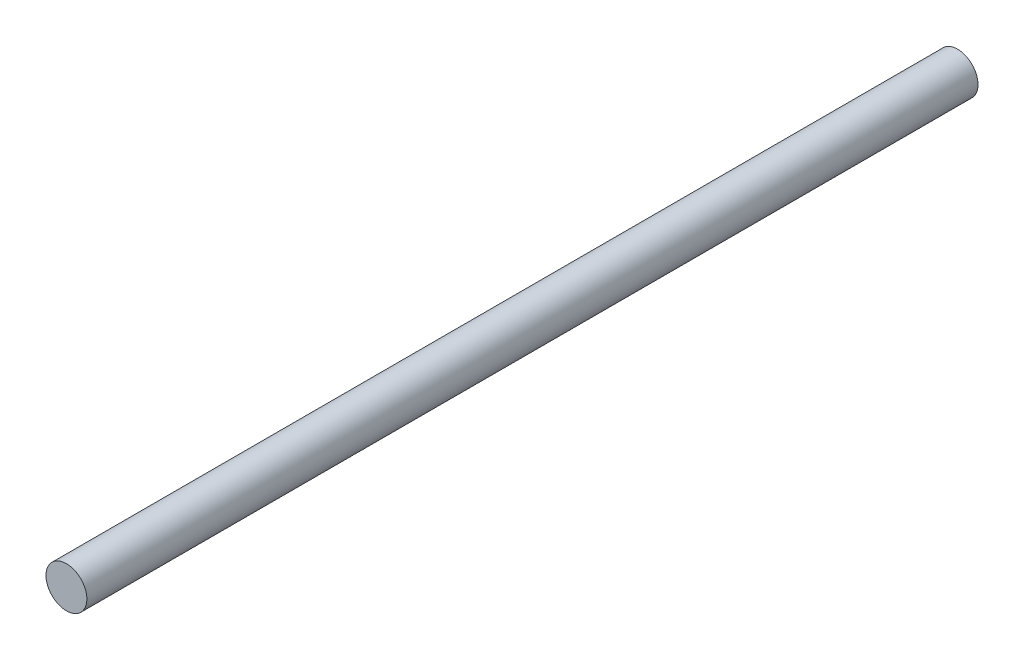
ISO-10303-21;
HEADER;
FILE_DESCRIPTION(('STEP AP214'),'2;1');
FILE_NAME('part.step','',(''),(''),'','','');
FILE_SCHEMA(('AUTOMOTIVE_DESIGN { 1 0 10303 214 1 1 1 1 }'));
ENDSEC;
DATA;
#1=APPLICATION_CONTEXT('core data for automotive mechanical design processes');
#2=APPLICATION_PROTOCOL_DEFINITION('international standard','automotive_design',2000,#1);
#3=PRODUCT_CONTEXT('',#1,'mechanical');
#4=PRODUCT('Part','Part','',(#3));
#5=PRODUCT_RELATED_PRODUCT_CATEGORY('part','',(#4));
#6=PRODUCT_DEFINITION_FORMATION('','',#4);
#7=PRODUCT_DEFINITION_CONTEXT('part definition',#1,'design');
#8=PRODUCT_DEFINITION('design','',#6,#7);
#9=PRODUCT_DEFINITION_SHAPE('','',#8);
#10=(LENGTH_UNIT() NAMED_UNIT(*) SI_UNIT(.MILLI.,.METRE.));
#11=(NAMED_UNIT(*) PLANE_ANGLE_UNIT() SI_UNIT($,.RADIAN.));
#12=(NAMED_UNIT(*) SI_UNIT($,.STERADIAN.) SOLID_ANGLE_UNIT());
#13=UNCERTAINTY_MEASURE_WITH_UNIT(LENGTH_MEASURE(1.E-05),#10,'distance_accuracy_value','');
#14=(GEOMETRIC_REPRESENTATION_CONTEXT(3) GLOBAL_UNCERTAINTY_ASSIGNED_CONTEXT((#13)) GLOBAL_UNIT_ASSIGNED_CONTEXT((#10,
#11,#12)) REPRESENTATION_CONTEXT('',''));
#15=CARTESIAN_POINT('',(0.,0.,0.));
#16=DIRECTION('',(0.,0.,1.));
#17=DIRECTION('',(1.,0.,0.));
#18=AXIS2_PLACEMENT_3D('',#15,#16,#17);
#19=CARTESIAN_POINT('',(4.384335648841,0.615664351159,0.5));
#20=DIRECTION('',(0.,0.,-1.));
#21=DIRECTION('',(1.,0.,0.));
#22=AXIS2_PLACEMENT_3D('',#19,#20,#21);
#23=PLANE('',#22);
#24=CARTESIAN_POINT('',(5.,0.,0.5));
#25=DIRECTION('',(0.,0.,-1.));
#26=DIRECTION('',(0.,1.,0.));
#27=AXIS2_PLACEMENT_3D('',#24,#25,#26);
#28=CIRCLE('',#27,0.585);
#29=CARTESIAN_POINT('',(5.,0.585000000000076,0.500000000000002));
#30=VERTEX_POINT('',#29);
#31=EDGE_CURVE('E18',#30,#30,#28,.T.);
#32=ORIENTED_EDGE('',*,*,#31,.T.);
#33=EDGE_LOOP('',(#32));
#34=FACE_BOUND('',#33,.T.);
#35=ADVANCED_FACE('F14',(#34),#23,.T.);
#36=CARTESIAN_POINT('',(5.,0.,26.));
#37=DIRECTION('',(0.,0.,-1.));
#38=DIRECTION('',(0.,1.,0.));
#39=AXIS2_PLACEMENT_3D('',#36,#37,#38);
#40=CYLINDRICAL_SURFACE('',#39,0.585);
#41=ORIENTED_EDGE('',*,*,#31,.F.);
#42=EDGE_LOOP('',(#41));
#43=FACE_BOUND('',#42,.T.);
#44=CARTESIAN_POINT('',(5.,0.,26.));
#45=DIRECTION('',(0.,0.,-1.));
#46=DIRECTION('',(0.,1.,0.));
#47=AXIS2_PLACEMENT_3D('',#44,#45,#46);
#48=CIRCLE('',#47,0.585);
#49=CARTESIAN_POINT('',(5.,0.585,26.));
#50=VERTEX_POINT('',#49);
#51=EDGE_CURVE('E10',#50,#50,#48,.T.);
#52=ORIENTED_EDGE('',*,*,#51,.T.);
#53=EDGE_LOOP('',(#52));
#54=FACE_BOUND('',#53,.T.);
#55=ADVANCED_FACE('F28',(#43,#54),#40,.T.);
#56=CARTESIAN_POINT('',(4.384335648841,0.615664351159,26.));
#57=DIRECTION('',(0.,0.,-1.));
#58=DIRECTION('',(1.,0.,0.));
#59=AXIS2_PLACEMENT_3D('',#56,#57,#58);
#60=PLANE('',#59);
#61=ORIENTED_EDGE('',*,*,#51,.F.);
#62=EDGE_LOOP('',(#61));
#63=FACE_BOUND('',#62,.T.);
#64=ADVANCED_FACE('F16',(#63),#60,.F.);
#65=CLOSED_SHELL('',(#35,#55,#64));
#66=MANIFOLD_SOLID_BREP('B1',#65);
#67=ADVANCED_BREP_SHAPE_REPRESENTATION('',(#18,#66),#14);
#68=SHAPE_DEFINITION_REPRESENTATION(#9,#67);
ENDSEC;
END-ISO-10303-21;
